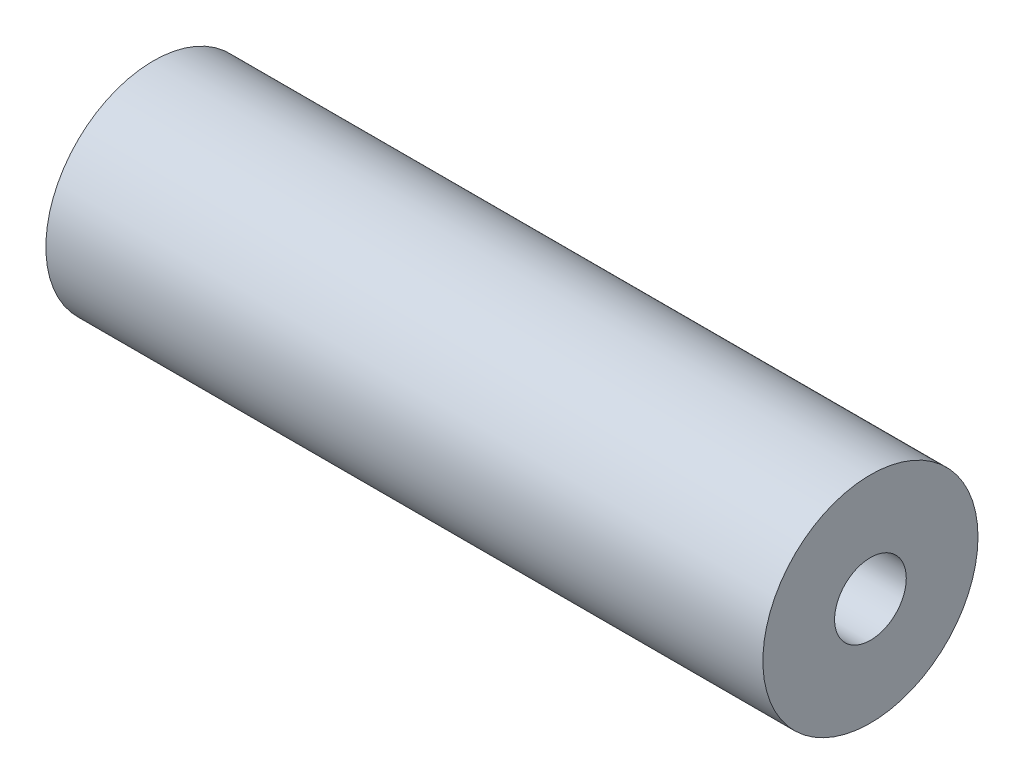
from build123d import *

# Parameters (mm, degrees)
SKETCH1_R           = 7.5
SKETCH1_R_2         = 2.5
BOSS_EXTRUDE1_DEPTH = 50


with BuildPart() as part:
    # Sketch1 → Boss-Extrude1 (new body)
    with BuildSketch(Plane(origin=(0, 0, 0), x_dir=(0, 0, -1), z_dir=(1, 0, 0))):
        Circle(SKETCH1_R)
        Circle(SKETCH1_R_2, mode=Mode.SUBTRACT)
    extrude(amount=BOSS_EXTRUDE1_DEPTH)


solid = part.part
